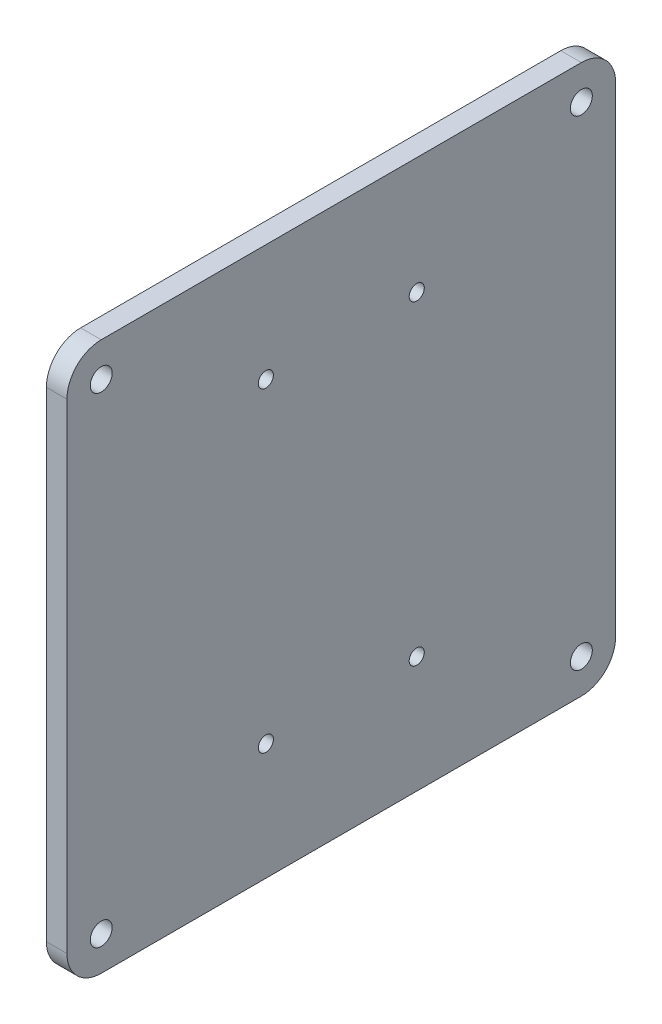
from build123d import *

# Parameters (mm, degrees)
ESQUISSE1_R        = 1.6
ESQUISSE1_R_2      = 1.1
BOSS_EXTRU_1_DEPTH = 3


with BuildPart() as part:
    # Esquisse1 → Boss.-Extru.1 (new body)
    with BuildSketch(Plane(origin=(0, 0, 0), x_dir=(0, 0, -1), z_dir=(1, 0, 0))):
        with BuildLine():
            Line((35, 40), (-35, 40))
            ThreePointArc((-35, 40), (-38.535533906, 38.535533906), (-40, 35))
            Line((-40, 35), (-40, -35))
            ThreePointArc((-40, -35), (-38.535533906, -38.535533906), (-35, -40))
            Line((-35, -40), (35, -40))
            ThreePointArc((35, -40), (38.535533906, -38.535533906), (40, -35))
            Line((40, -35), (40, 35))
            ThreePointArc((40, 35), (38.535533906, 38.535533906), (35, 40))
        make_face()
        with Locations((-35, 35)):
            Circle(ESQUISSE1_R, mode=Mode.SUBTRACT)
        with Locations((-11, 23)):
            Circle(ESQUISSE1_R_2, mode=Mode.SUBTRACT)
        with Locations(Location((35, 35, 0), (0, 0, 180))):
            Circle(ESQUISSE1_R, mode=Mode.SUBTRACT)
        with Locations(Location((11, 23, 0), (0, 0, 180))):
            Circle(ESQUISSE1_R_2, mode=Mode.SUBTRACT)
        with Locations((35, -35)):
            Circle(ESQUISSE1_R, mode=Mode.SUBTRACT)
        with Locations((11, -23)):
            Circle(ESQUISSE1_R_2, mode=Mode.SUBTRACT)
        with Locations(Location((-11, -23, 0), (0, 0, 180))):
            Circle(ESQUISSE1_R_2, mode=Mode.SUBTRACT)
        with Locations(Location((-35, -35, 0), (0, 0, 180))):
            Circle(ESQUISSE1_R, mode=Mode.SUBTRACT)
    extrude(amount=BOSS_EXTRU_1_DEPTH)


solid = part.part
